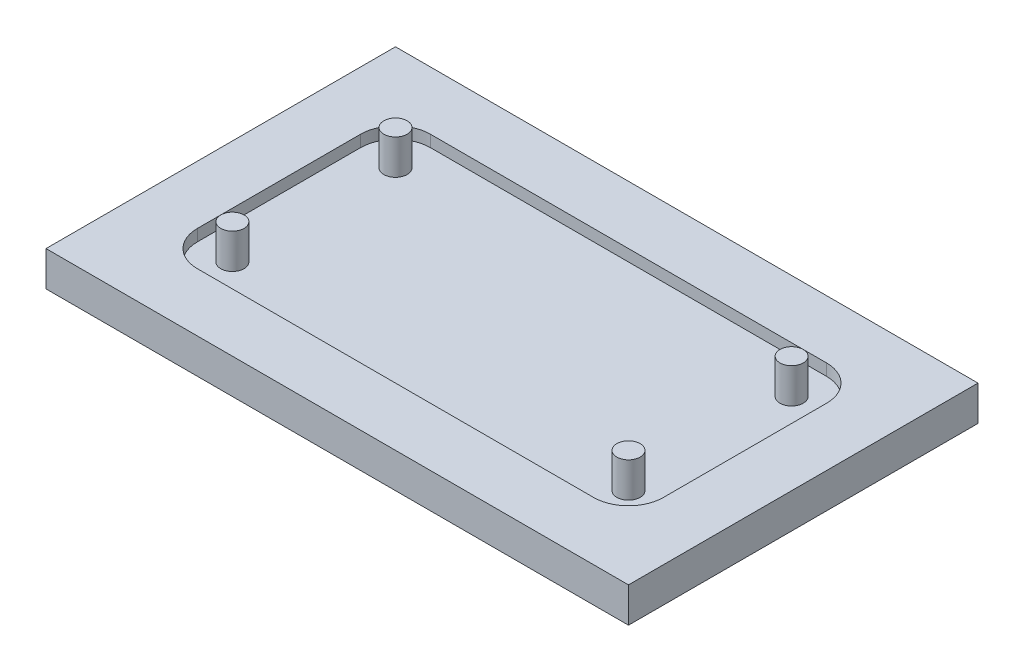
from build123d import *

# Parameters (mm, degrees)
BOSS_EXTRUDE1_DEPTH = 10
SKETCH2_R           = 5
BOSS_EXTRUDE2_DEPTH = 15
SKETCH3_W           = 250
SKETCH3_H           = 150
BOSS_EXTRUDE3_DEPTH = 15


with BuildPart() as part:
    # Sketch1 → Boss-Extrude1 (new body)
    with BuildSketch(Plane(origin=(0, 0, 0), x_dir=(1, 0, 0), z_dir=(0, 1, 0))):
        with BuildLine():
            Line((-85, -50), (85, -50))
            ThreePointArc((85, -50), (95.606601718, -45.606601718), (100, -35))
            Line((100, -35), (100, 35))
            ThreePointArc((100, 35), (95.606601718, 45.606601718), (85, 50))
            Line((85, 50), (-85, 50))
            ThreePointArc((-85, 50), (-95.606601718, 45.606601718), (-100, 35))
            Line((-100, 35), (-100, -35))
            ThreePointArc((-100, -35), (-95.606601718, -45.606601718), (-85, -50))
        make_face()
    extrude(amount=BOSS_EXTRUDE1_DEPTH)

    # Sketch2 → Boss-Extrude2 (add)
    with BuildSketch(Plane(origin=(0, 10, 0), x_dir=(1, 0, 0), z_dir=(0, 1, 0))):
        with Locations(Location((-85, 35, 0), (0, 0, 90))):
            Circle(SKETCH2_R)
        with Locations(Location((-85, -35, 0), (0, 0, 90))):
            Circle(SKETCH2_R)
        with Locations(Location((85, 35, 0), (0, 0, 90))):
            Circle(SKETCH2_R)
        with Locations(Location((85, -35, 0), (0, 0, 90))):
            Circle(SKETCH2_R)
    extrude(amount=BOSS_EXTRUDE2_DEPTH)

    # Sketch3 → Boss-Extrude3 (add)
    with BuildSketch(Plane.XZ):
        Rectangle(SKETCH3_W, SKETCH3_H)
        with BuildLine():
            Line((-85, -50), (85, -50))
            ThreePointArc((85, -50), (95.606601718, -45.606601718), (100, -35))
            Line((100, -35), (100, 35))
            ThreePointArc((100, 35), (95.606601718, 45.606601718), (85, 50))
            Line((85, 50), (-85, 50))
            ThreePointArc((-85, 50), (-95.606601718, 45.606601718), (-100, 35))
            Line((-100, 35), (-100, -35))
            ThreePointArc((-100, -35), (-95.606601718, -45.606601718), (-85, -50))
        make_face(mode=Mode.SUBTRACT)
    extrude(amount=-BOSS_EXTRUDE3_DEPTH)


solid = part.part
